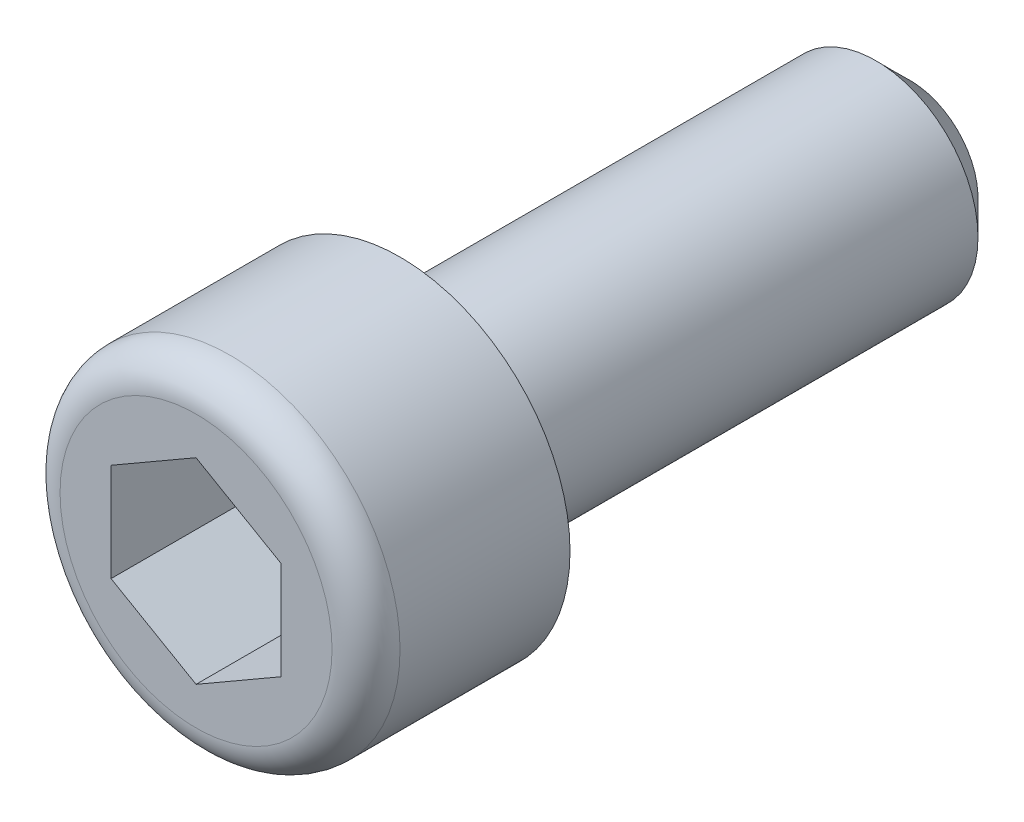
ISO-10303-21;
HEADER;
FILE_DESCRIPTION(('STEP AP214'),'2;1');
FILE_NAME('part.step','',(''),(''),'','','');
FILE_SCHEMA(('AUTOMOTIVE_DESIGN { 1 0 10303 214 1 1 1 1 }'));
ENDSEC;
DATA;
#1=APPLICATION_CONTEXT('core data for automotive mechanical design processes');
#2=APPLICATION_PROTOCOL_DEFINITION('international standard','automotive_design',2000,#1);
#3=PRODUCT_CONTEXT('',#1,'mechanical');
#4=PRODUCT('Part','Part','',(#3));
#5=PRODUCT_RELATED_PRODUCT_CATEGORY('part','',(#4));
#6=PRODUCT_DEFINITION_FORMATION('','',#4);
#7=PRODUCT_DEFINITION_CONTEXT('part definition',#1,'design');
#8=PRODUCT_DEFINITION('design','',#6,#7);
#9=PRODUCT_DEFINITION_SHAPE('','',#8);
#10=(LENGTH_UNIT() NAMED_UNIT(*) SI_UNIT(.MILLI.,.METRE.));
#11=(NAMED_UNIT(*) PLANE_ANGLE_UNIT() SI_UNIT($,.RADIAN.));
#12=(NAMED_UNIT(*) SI_UNIT($,.STERADIAN.) SOLID_ANGLE_UNIT());
#13=UNCERTAINTY_MEASURE_WITH_UNIT(LENGTH_MEASURE(1.E-05),#10,'distance_accuracy_value','');
#14=(GEOMETRIC_REPRESENTATION_CONTEXT(3) GLOBAL_UNCERTAINTY_ASSIGNED_CONTEXT((#13)) GLOBAL_UNIT_ASSIGNED_CONTEXT((#10,
#11,#12)) REPRESENTATION_CONTEXT('',''));
#15=CARTESIAN_POINT('',(0.,0.,0.));
#16=DIRECTION('',(0.,0.,1.));
#17=DIRECTION('',(1.,0.,0.));
#18=AXIS2_PLACEMENT_3D('',#15,#16,#17);
#19=CARTESIAN_POINT('',(0.,0.,-6.));
#20=DIRECTION('',(0.,0.,1.));
#21=DIRECTION('',(1.,0.,0.));
#22=AXIS2_PLACEMENT_3D('',#19,#20,#21);
#23=CYLINDRICAL_SURFACE('',#22,5.);
#24=CARTESIAN_POINT('',(0.,0.,-1.));
#25=DIRECTION('',(0.,0.,1.));
#26=DIRECTION('',(1.,0.,0.));
#27=AXIS2_PLACEMENT_3D('',#24,#25,#26);
#28=CIRCLE('',#27,5.);
#29=CARTESIAN_POINT('',(5.,0.,-1.));
#30=VERTEX_POINT('',#29);
#31=EDGE_CURVE('E11',#30,#30,#28,.F.);
#32=ORIENTED_EDGE('',*,*,#31,.T.);
#33=EDGE_LOOP('',(#32));
#34=FACE_BOUND('',#33,.T.);
#35=CARTESIAN_POINT('',(0.,0.,-6.));
#36=DIRECTION('',(0.,0.,1.));
#37=DIRECTION('',(1.,0.,0.));
#38=AXIS2_PLACEMENT_3D('',#35,#36,#37);
#39=CIRCLE('',#38,5.);
#40=CARTESIAN_POINT('',(5.,0.,-6.));
#41=VERTEX_POINT('',#40);
#42=EDGE_CURVE('E137',#41,#41,#39,.T.);
#43=ORIENTED_EDGE('',*,*,#42,.T.);
#44=EDGE_LOOP('',(#43));
#45=FACE_BOUND('',#44,.T.);
#46=ADVANCED_FACE('F35',(#34,#45),#23,.T.);
#47=CARTESIAN_POINT('',(0.,0.,-6.));
#48=DIRECTION('',(0.,0.,1.));
#49=DIRECTION('',(1.,0.,0.));
#50=AXIS2_PLACEMENT_3D('',#47,#48,#49);
#51=PLANE('',#50);
#52=CARTESIAN_POINT('',(0.,0.,-6.));
#53=DIRECTION('',(0.,0.,1.));
#54=DIRECTION('',(1.,0.,0.));
#55=AXIS2_PLACEMENT_3D('',#52,#53,#54);
#56=CIRCLE('',#55,3.);
#57=CARTESIAN_POINT('',(3.,0.,-6.));
#58=VERTEX_POINT('',#57);
#59=EDGE_CURVE('E145',#58,#58,#56,.F.);
#60=ORIENTED_EDGE('',*,*,#59,.F.);
#61=EDGE_LOOP('',(#60));
#62=FACE_BOUND('',#61,.T.);
#63=ORIENTED_EDGE('',*,*,#42,.F.);
#64=EDGE_LOOP('',(#63));
#65=FACE_BOUND('',#64,.T.);
#66=ADVANCED_FACE('F168',(#62,#65),#51,.F.);
#67=CARTESIAN_POINT('',(0.,0.,0.));
#68=DIRECTION('',(0.,0.,1.));
#69=DIRECTION('',(1.,0.,0.));
#70=AXIS2_PLACEMENT_3D('',#67,#68,#69);
#71=PLANE('',#70);
#72=CARTESIAN_POINT('',(0.,0.,0.));
#73=DIRECTION('',(0.,0.,1.));
#74=DIRECTION('',(1.,0.,0.));
#75=AXIS2_PLACEMENT_3D('',#72,#73,#74);
#76=CIRCLE('',#75,4.);
#77=CARTESIAN_POINT('',(4.,0.,0.));
#78=VERTEX_POINT('',#77);
#79=EDGE_CURVE('E43',#78,#78,#76,.T.);
#80=ORIENTED_EDGE('',*,*,#79,.T.);
#81=EDGE_LOOP('',(#80));
#82=FACE_BOUND('',#81,.T.);
#83=DIRECTION('',(0.,-1.,0.));
#84=VECTOR('',#83,1.);
#85=CARTESIAN_POINT('',(-2.5,1.44337567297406,0.));
#86=LINE('',#85,#84);
#87=CARTESIAN_POINT('',(-2.5,1.44337567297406,0.));
#88=VERTEX_POINT('',#87);
#89=CARTESIAN_POINT('',(-2.5,-1.44337567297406,0.));
#90=VERTEX_POINT('',#89);
#91=EDGE_CURVE('E50',#88,#90,#86,.T.);
#92=ORIENTED_EDGE('',*,*,#91,.F.);
#93=DIRECTION('',(-0.866025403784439,-0.5,0.));
#94=VECTOR('',#93,1.);
#95=CARTESIAN_POINT('',(0.,2.88675134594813,0.));
#96=LINE('',#95,#94);
#97=CARTESIAN_POINT('',(0.,2.88675134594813,0.));
#98=VERTEX_POINT('',#97);
#99=EDGE_CURVE('E133',#98,#88,#96,.T.);
#100=ORIENTED_EDGE('',*,*,#99,.F.);
#101=DIRECTION('',(-0.866025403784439,0.5,0.));
#102=VECTOR('',#101,1.);
#103=CARTESIAN_POINT('',(2.5,1.44337567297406,0.));
#104=LINE('',#103,#102);
#105=CARTESIAN_POINT('',(2.5,1.44337567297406,0.));
#106=VERTEX_POINT('',#105);
#107=EDGE_CURVE('E131',#106,#98,#104,.T.);
#108=ORIENTED_EDGE('',*,*,#107,.F.);
#109=DIRECTION('',(0.,1.,0.));
#110=VECTOR('',#109,1.);
#111=CARTESIAN_POINT('',(2.5,-1.44337567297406,0.));
#112=LINE('',#111,#110);
#113=CARTESIAN_POINT('',(2.5,-1.44337567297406,0.));
#114=VERTEX_POINT('',#113);
#115=EDGE_CURVE('E98',#114,#106,#112,.T.);
#116=ORIENTED_EDGE('',*,*,#115,.F.);
#117=DIRECTION('',(0.866025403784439,0.5,0.));
#118=VECTOR('',#117,1.);
#119=CARTESIAN_POINT('',(0.,-2.88675134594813,0.));
#120=LINE('',#119,#118);
#121=CARTESIAN_POINT('',(0.,-2.88675134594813,0.));
#122=VERTEX_POINT('',#121);
#123=EDGE_CURVE('E127',#122,#114,#120,.T.);
#124=ORIENTED_EDGE('',*,*,#123,.F.);
#125=DIRECTION('',(0.866025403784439,-0.5,0.));
#126=VECTOR('',#125,1.);
#127=CARTESIAN_POINT('',(-2.5,-1.44337567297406,0.));
#128=LINE('',#127,#126);
#129=EDGE_CURVE('E124',#90,#122,#128,.T.);
#130=ORIENTED_EDGE('',*,*,#129,.F.);
#131=EDGE_LOOP('',(#92,#100,#108,#116,#124,#130));
#132=FACE_BOUND('',#131,.T.);
#133=ADVANCED_FACE('F156',(#82,#132),#71,.T.);
#134=CARTESIAN_POINT('',(0.,0.,-21.));
#135=DIRECTION('',(0.,0.,1.));
#136=DIRECTION('',(1.,0.,0.));
#137=AXIS2_PLACEMENT_3D('',#134,#135,#136);
#138=CYLINDRICAL_SURFACE('',#137,3.);
#139=CARTESIAN_POINT('',(0.,0.,-20.));
#140=DIRECTION('',(0.,0.,-1.));
#141=DIRECTION('',(-1.,0.,0.));
#142=AXIS2_PLACEMENT_3D('',#139,#140,#141);
#143=CIRCLE('',#142,3.);
#144=CARTESIAN_POINT('',(-3.,0.,-20.));
#145=VERTEX_POINT('',#144);
#146=EDGE_CURVE('E151',#145,#145,#143,.F.);
#147=ORIENTED_EDGE('',*,*,#146,.T.);
#148=EDGE_LOOP('',(#147));
#149=FACE_BOUND('',#148,.T.);
#150=ORIENTED_EDGE('',*,*,#59,.T.);
#151=EDGE_LOOP('',(#150));
#152=FACE_BOUND('',#151,.T.);
#153=ADVANCED_FACE('F189',(#149,#152),#138,.T.);
#154=CARTESIAN_POINT('',(0.,0.,-21.));
#155=DIRECTION('',(0.,0.,-1.));
#156=DIRECTION('',(-1.,0.,0.));
#157=AXIS2_PLACEMENT_3D('',#154,#155,#156);
#158=PLANE('',#157);
#159=CARTESIAN_POINT('',(0.,0.,-21.));
#160=DIRECTION('',(0.,0.,-1.));
#161=DIRECTION('',(-1.,0.,0.));
#162=AXIS2_PLACEMENT_3D('',#159,#160,#161);
#163=CIRCLE('',#162,2.);
#164=CARTESIAN_POINT('',(-2.,0.,-21.));
#165=VERTEX_POINT('',#164);
#166=EDGE_CURVE('E148',#165,#165,#163,.T.);
#167=ORIENTED_EDGE('',*,*,#166,.T.);
#168=EDGE_LOOP('',(#167));
#169=FACE_BOUND('',#168,.T.);
#170=ADVANCED_FACE('F181',(#169),#158,.T.);
#171=CARTESIAN_POINT('',(0.,0.,-21.));
#172=DIRECTION('',(0.,0.,1.));
#173=DIRECTION('',(1.,0.,0.));
#174=AXIS2_PLACEMENT_3D('',#171,#172,#173);
#175=CONICAL_SURFACE('',#174,2.,0.785398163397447);
#176=ORIENTED_EDGE('',*,*,#146,.F.);
#177=EDGE_LOOP('',(#176));
#178=FACE_BOUND('',#177,.T.);
#179=ORIENTED_EDGE('',*,*,#166,.F.);
#180=EDGE_LOOP('',(#179));
#181=FACE_BOUND('',#180,.T.);
#182=ADVANCED_FACE('F178',(#178,#181),#175,.T.);
#183=CARTESIAN_POINT('',(-2.5,1.44337567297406,-4.));
#184=DIRECTION('',(-1.,0.,0.));
#185=DIRECTION('',(0.,0.,1.));
#186=AXIS2_PLACEMENT_3D('',#183,#184,#185);
#187=PLANE('',#186);
#188=ORIENTED_EDGE('',*,*,#91,.T.);
#189=DIRECTION('',(0.,0.,1.));
#190=VECTOR('',#189,1.);
#191=CARTESIAN_POINT('',(-2.5,-1.44337567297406,-4.));
#192=LINE('',#191,#190);
#193=CARTESIAN_POINT('',(-2.5,-1.44337567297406,-4.));
#194=VERTEX_POINT('',#193);
#195=EDGE_CURVE('E80',#194,#90,#192,.T.);
#196=ORIENTED_EDGE('',*,*,#195,.F.);
#197=DIRECTION('',(0.,-1.,0.));
#198=VECTOR('',#197,1.);
#199=CARTESIAN_POINT('',(-2.5,1.44337567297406,-4.));
#200=LINE('',#199,#198);
#201=CARTESIAN_POINT('',(-2.5,1.44337567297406,-4.));
#202=VERTEX_POINT('',#201);
#203=EDGE_CURVE('E135',#202,#194,#200,.T.);
#204=ORIENTED_EDGE('',*,*,#203,.F.);
#205=DIRECTION('',(0.,0.,1.));
#206=VECTOR('',#205,1.);
#207=CARTESIAN_POINT('',(-2.5,1.44337567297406,-4.));
#208=LINE('',#207,#206);
#209=EDGE_CURVE('E58',#202,#88,#208,.T.);
#210=ORIENTED_EDGE('',*,*,#209,.T.);
#211=EDGE_LOOP('',(#188,#196,#204,#210));
#212=FACE_BOUND('',#211,.T.);
#213=ADVANCED_FACE('F180',(#212),#187,.F.);
#214=CARTESIAN_POINT('',(0.,2.88675134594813,-4.));
#215=DIRECTION('',(-0.5,0.866025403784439,0.));
#216=DIRECTION('',(-0.866025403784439,-0.5,0.));
#217=AXIS2_PLACEMENT_3D('',#214,#215,#216);
#218=PLANE('',#217);
#219=ORIENTED_EDGE('',*,*,#99,.T.);
#220=ORIENTED_EDGE('',*,*,#209,.F.);
#221=DIRECTION('',(-0.866025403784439,-0.5,0.));
#222=VECTOR('',#221,1.);
#223=CARTESIAN_POINT('',(0.,2.88675134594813,-4.));
#224=LINE('',#223,#222);
#225=CARTESIAN_POINT('',(0.,2.88675134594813,-4.));
#226=VERTEX_POINT('',#225);
#227=EDGE_CURVE('E110',#226,#202,#224,.T.);
#228=ORIENTED_EDGE('',*,*,#227,.F.);
#229=DIRECTION('',(0.,0.,1.));
#230=VECTOR('',#229,1.);
#231=CARTESIAN_POINT('',(0.,2.88675134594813,-4.));
#232=LINE('',#231,#230);
#233=EDGE_CURVE('E102',#226,#98,#232,.T.);
#234=ORIENTED_EDGE('',*,*,#233,.T.);
#235=EDGE_LOOP('',(#219,#220,#228,#234));
#236=FACE_BOUND('',#235,.T.);
#237=ADVANCED_FACE('F187',(#236),#218,.F.);
#238=CARTESIAN_POINT('',(2.5,1.44337567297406,-4.));
#239=DIRECTION('',(0.5,0.866025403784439,0.));
#240=DIRECTION('',(-0.866025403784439,0.5,0.));
#241=AXIS2_PLACEMENT_3D('',#238,#239,#240);
#242=PLANE('',#241);
#243=ORIENTED_EDGE('',*,*,#107,.T.);
#244=ORIENTED_EDGE('',*,*,#233,.F.);
#245=DIRECTION('',(-0.866025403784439,0.5,0.));
#246=VECTOR('',#245,1.);
#247=CARTESIAN_POINT('',(2.5,1.44337567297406,-4.));
#248=LINE('',#247,#246);
#249=CARTESIAN_POINT('',(2.5,1.44337567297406,-4.));
#250=VERTEX_POINT('',#249);
#251=EDGE_CURVE('E106',#250,#226,#248,.T.);
#252=ORIENTED_EDGE('',*,*,#251,.F.);
#253=DIRECTION('',(0.,0.,1.));
#254=VECTOR('',#253,1.);
#255=CARTESIAN_POINT('',(2.5,1.44337567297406,-4.));
#256=LINE('',#255,#254);
#257=EDGE_CURVE('E91',#250,#106,#256,.T.);
#258=ORIENTED_EDGE('',*,*,#257,.T.);
#259=EDGE_LOOP('',(#243,#244,#252,#258));
#260=FACE_BOUND('',#259,.T.);
#261=ADVANCED_FACE('F107',(#260),#242,.F.);
#262=CARTESIAN_POINT('',(2.5,-1.44337567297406,-4.));
#263=DIRECTION('',(1.,0.,0.));
#264=DIRECTION('',(0.,0.,-1.));
#265=AXIS2_PLACEMENT_3D('',#262,#263,#264);
#266=PLANE('',#265);
#267=ORIENTED_EDGE('',*,*,#115,.T.);
#268=ORIENTED_EDGE('',*,*,#257,.F.);
#269=DIRECTION('',(0.,1.,0.));
#270=VECTOR('',#269,1.);
#271=CARTESIAN_POINT('',(2.5,-1.44337567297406,-4.));
#272=LINE('',#271,#270);
#273=CARTESIAN_POINT('',(2.5,-1.44337567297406,-4.));
#274=VERTEX_POINT('',#273);
#275=EDGE_CURVE('E95',#274,#250,#272,.T.);
#276=ORIENTED_EDGE('',*,*,#275,.F.);
#277=DIRECTION('',(0.,0.,1.));
#278=VECTOR('',#277,1.);
#279=CARTESIAN_POINT('',(2.5,-1.44337567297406,-4.));
#280=LINE('',#279,#278);
#281=EDGE_CURVE('E103',#274,#114,#280,.T.);
#282=ORIENTED_EDGE('',*,*,#281,.T.);
#283=EDGE_LOOP('',(#267,#268,#276,#282));
#284=FACE_BOUND('',#283,.T.);
#285=ADVANCED_FACE('F93',(#284),#266,.F.);
#286=CARTESIAN_POINT('',(0.,-2.88675134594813,-4.));
#287=DIRECTION('',(0.5,-0.866025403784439,0.));
#288=DIRECTION('',(0.866025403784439,0.5,0.));
#289=AXIS2_PLACEMENT_3D('',#286,#287,#288);
#290=PLANE('',#289);
#291=ORIENTED_EDGE('',*,*,#123,.T.);
#292=ORIENTED_EDGE('',*,*,#281,.F.);
#293=DIRECTION('',(0.866025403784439,0.5,0.));
#294=VECTOR('',#293,1.);
#295=CARTESIAN_POINT('',(0.,-2.88675134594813,-4.));
#296=LINE('',#295,#294);
#297=CARTESIAN_POINT('',(0.,-2.88675134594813,-4.));
#298=VERTEX_POINT('',#297);
#299=EDGE_CURVE('E116',#298,#274,#296,.T.);
#300=ORIENTED_EDGE('',*,*,#299,.F.);
#301=DIRECTION('',(0.,0.,1.));
#302=VECTOR('',#301,1.);
#303=CARTESIAN_POINT('',(0.,-2.88675134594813,-4.));
#304=LINE('',#303,#302);
#305=EDGE_CURVE('E140',#298,#122,#304,.T.);
#306=ORIENTED_EDGE('',*,*,#305,.T.);
#307=EDGE_LOOP('',(#291,#292,#300,#306));
#308=FACE_BOUND('',#307,.T.);
#309=ADVANCED_FACE('F208',(#308),#290,.F.);
#310=CARTESIAN_POINT('',(-2.5,-1.44337567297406,-4.));
#311=DIRECTION('',(-0.5,-0.866025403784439,0.));
#312=DIRECTION('',(0.866025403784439,-0.5,0.));
#313=AXIS2_PLACEMENT_3D('',#310,#311,#312);
#314=PLANE('',#313);
#315=ORIENTED_EDGE('',*,*,#129,.T.);
#316=ORIENTED_EDGE('',*,*,#305,.F.);
#317=DIRECTION('',(0.866025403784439,-0.5,0.));
#318=VECTOR('',#317,1.);
#319=CARTESIAN_POINT('',(-2.5,-1.44337567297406,-4.));
#320=LINE('',#319,#318);
#321=EDGE_CURVE('E118',#194,#298,#320,.T.);
#322=ORIENTED_EDGE('',*,*,#321,.F.);
#323=ORIENTED_EDGE('',*,*,#195,.T.);
#324=EDGE_LOOP('',(#315,#316,#322,#323));
#325=FACE_BOUND('',#324,.T.);
#326=ADVANCED_FACE('F164',(#325),#314,.F.);
#327=CARTESIAN_POINT('',(-2.5,-1.44337567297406,-4.));
#328=DIRECTION('',(0.,0.,1.));
#329=DIRECTION('',(1.,0.,0.));
#330=AXIS2_PLACEMENT_3D('',#327,#328,#329);
#331=PLANE('',#330);
#332=ORIENTED_EDGE('',*,*,#203,.T.);
#333=ORIENTED_EDGE('',*,*,#321,.T.);
#334=ORIENTED_EDGE('',*,*,#299,.T.);
#335=ORIENTED_EDGE('',*,*,#275,.T.);
#336=ORIENTED_EDGE('',*,*,#251,.T.);
#337=ORIENTED_EDGE('',*,*,#227,.T.);
#338=EDGE_LOOP('',(#332,#333,#334,#335,#336,#337));
#339=FACE_BOUND('',#338,.T.);
#340=ADVANCED_FACE('F113',(#339),#331,.T.);
#341=CARTESIAN_POINT('',(0.,0.,-1.));
#342=DIRECTION('',(0.,0.,1.));
#343=DIRECTION('',(1.,0.,0.));
#344=AXIS2_PLACEMENT_3D('',#341,#342,#343);
#345=TOROIDAL_SURFACE('',#344,4.,1.);
#346=ORIENTED_EDGE('',*,*,#31,.F.);
#347=EDGE_LOOP('',(#346));
#348=FACE_BOUND('',#347,.T.);
#349=ORIENTED_EDGE('',*,*,#79,.F.);
#350=EDGE_LOOP('',(#349));
#351=FACE_BOUND('',#350,.T.);
#352=ADVANCED_FACE('F37',(#348,#351),#345,.T.);
#353=CLOSED_SHELL('',(#46,#66,#133,#153,#170,#182,#213,#237,#261,#285,#309,#326,#340,#352));
#354=MANIFOLD_SOLID_BREP('B2',#353);
#355=ADVANCED_BREP_SHAPE_REPRESENTATION('',(#18,#354),#14);
#356=SHAPE_DEFINITION_REPRESENTATION(#9,#355);
ENDSEC;
END-ISO-10303-21;
